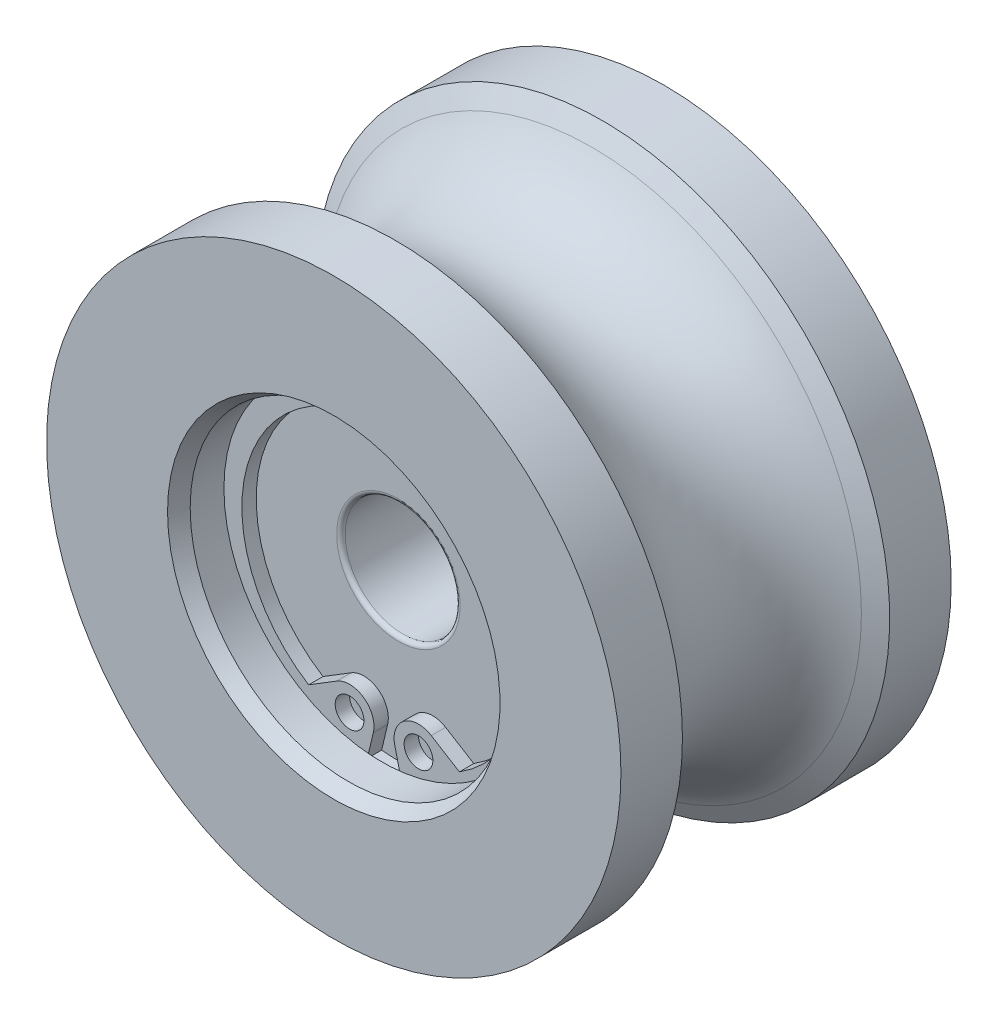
ISO-10303-21;
HEADER;
FILE_DESCRIPTION(('STEP AP214'),'2;1');
FILE_NAME('part.step','',(''),(''),'','','');
FILE_SCHEMA(('AUTOMOTIVE_DESIGN { 1 0 10303 214 1 1 1 1 }'));
ENDSEC;
DATA;
#1=APPLICATION_CONTEXT('core data for automotive mechanical design processes');
#2=APPLICATION_PROTOCOL_DEFINITION('international standard','automotive_design',2000,#1);
#3=PRODUCT_CONTEXT('',#1,'mechanical');
#4=PRODUCT('Part','Part','',(#3));
#5=PRODUCT_RELATED_PRODUCT_CATEGORY('part','',(#4));
#6=PRODUCT_DEFINITION_FORMATION('','',#4);
#7=PRODUCT_DEFINITION_CONTEXT('part definition',#1,'design');
#8=PRODUCT_DEFINITION('design','',#6,#7);
#9=PRODUCT_DEFINITION_SHAPE('','',#8);
#10=(LENGTH_UNIT() NAMED_UNIT(*) SI_UNIT(.MILLI.,.METRE.));
#11=(NAMED_UNIT(*) PLANE_ANGLE_UNIT() SI_UNIT($,.RADIAN.));
#12=(NAMED_UNIT(*) SI_UNIT($,.STERADIAN.) SOLID_ANGLE_UNIT());
#13=UNCERTAINTY_MEASURE_WITH_UNIT(LENGTH_MEASURE(1.E-05),#10,'distance_accuracy_value','');
#14=(GEOMETRIC_REPRESENTATION_CONTEXT(3) GLOBAL_UNCERTAINTY_ASSIGNED_CONTEXT((#13)) GLOBAL_UNIT_ASSIGNED_CONTEXT((#10,
#11,#12)) REPRESENTATION_CONTEXT('',''));
#15=CARTESIAN_POINT('',(0.,0.,0.));
#16=DIRECTION('',(0.,0.,1.));
#17=DIRECTION('',(1.,0.,0.));
#18=AXIS2_PLACEMENT_3D('',#15,#16,#17);
#19=CARTESIAN_POINT('',(0.,-0.65,8.));
#20=DIRECTION('',(0.,0.,1.));
#21=DIRECTION('',(-1.,0.,0.));
#22=AXIS2_PLACEMENT_3D('',#19,#20,#21);
#23=CYLINDRICAL_SURFACE('',#22,9.9);
#24=CARTESIAN_POINT('',(0.,-0.65,7.));
#25=DIRECTION('',(0.,0.,-1.));
#26=DIRECTION('',(0.,-1.,0.));
#27=AXIS2_PLACEMENT_3D('',#24,#25,#26);
#28=CIRCLE('',#27,9.9);
#29=CARTESIAN_POINT('',(-5.24892182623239,-9.04397520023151,7.));
#30=VERTEX_POINT('',#29);
#31=CARTESIAN_POINT('',(5.2489218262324,-9.04397520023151,7.));
#32=VERTEX_POINT('',#31);
#33=EDGE_CURVE('E605',#30,#32,#28,.T.);
#34=ORIENTED_EDGE('',*,*,#33,.T.);
#35=DIRECTION('',(0.,0.,-1.));
#36=VECTOR('',#35,1.);
#37=CARTESIAN_POINT('',(5.2489218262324,-9.04397520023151,8.));
#38=LINE('',#37,#36);
#39=CARTESIAN_POINT('',(5.2489218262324,-9.04397520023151,8.));
#40=VERTEX_POINT('',#39);
#41=EDGE_CURVE('E130',#40,#32,#38,.T.);
#42=ORIENTED_EDGE('',*,*,#41,.F.);
#43=CARTESIAN_POINT('',(0.,-0.65,8.));
#44=DIRECTION('',(0.,0.,-1.));
#45=DIRECTION('',(0.,-1.,0.));
#46=AXIS2_PLACEMENT_3D('',#43,#44,#45);
#47=CIRCLE('',#46,9.9);
#48=CARTESIAN_POINT('',(-5.24892182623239,-9.04397520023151,8.));
#49=VERTEX_POINT('',#48);
#50=EDGE_CURVE('E579',#49,#40,#47,.T.);
#51=ORIENTED_EDGE('',*,*,#50,.F.);
#52=DIRECTION('',(0.,0.,-1.));
#53=VECTOR('',#52,1.);
#54=CARTESIAN_POINT('',(-5.24892182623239,-9.04397520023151,8.));
#55=LINE('',#54,#53);
#56=EDGE_CURVE('E123',#49,#30,#55,.T.);
#57=ORIENTED_EDGE('',*,*,#56,.T.);
#58=EDGE_LOOP('',(#34,#42,#51,#57));
#59=FACE_BOUND('',#58,.T.);
#60=ADVANCED_FACE('F14',(#59),#23,.F.);
#61=CARTESIAN_POINT('',(3.29136923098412,-7.83857489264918,8.));
#62=DIRECTION('',(-0.524334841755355,-0.851512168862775,0.));
#63=DIRECTION('',(-0.851512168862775,0.524334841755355,0.));
#64=AXIS2_PLACEMENT_3D('',#61,#62,#63);
#65=PLANE('',#64);
#66=DIRECTION('',(-0.851512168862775,0.524334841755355,0.));
#67=VECTOR('',#66,1.);
#68=CARTESIAN_POINT('',(3.29136923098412,-7.83857489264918,7.));
#69=LINE('',#68,#67);
#70=CARTESIAN_POINT('',(3.29136923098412,-7.83857489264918,7.));
#71=VERTEX_POINT('',#70);
#72=EDGE_CURVE('E134',#32,#71,#69,.T.);
#73=ORIENTED_EDGE('',*,*,#72,.T.);
#74=DIRECTION('',(0.,0.,-1.));
#75=VECTOR('',#74,1.);
#76=CARTESIAN_POINT('',(3.29136923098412,-7.83857489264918,8.));
#77=LINE('',#76,#75);
#78=CARTESIAN_POINT('',(3.29136923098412,-7.83857489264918,8.));
#79=VERTEX_POINT('',#78);
#80=EDGE_CURVE('E96',#79,#71,#77,.T.);
#81=ORIENTED_EDGE('',*,*,#80,.F.);
#82=DIRECTION('',(-0.851512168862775,0.524334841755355,0.));
#83=VECTOR('',#82,1.);
#84=CARTESIAN_POINT('',(3.29136923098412,-7.83857489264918,8.));
#85=LINE('',#84,#83);
#86=EDGE_CURVE('E582',#40,#79,#85,.T.);
#87=ORIENTED_EDGE('',*,*,#86,.F.);
#88=ORIENTED_EDGE('',*,*,#41,.T.);
#89=EDGE_LOOP('',(#73,#81,#87,#88));
#90=FACE_BOUND('',#89,.T.);
#91=ADVANCED_FACE('F224',(#90),#65,.F.);
#92=CARTESIAN_POINT('',(2.4,-9.28614557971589,8.));
#93=DIRECTION('',(0.,0.,1.));
#94=DIRECTION('',(-1.,0.,0.));
#95=AXIS2_PLACEMENT_3D('',#92,#93,#94);
#96=CYLINDRICAL_SURFACE('',#95,1.7);
#97=CARTESIAN_POINT('',(2.4,-9.28614557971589,7.));
#98=DIRECTION('',(0.,0.,1.));
#99=DIRECTION('',(1.,0.,0.));
#100=AXIS2_PLACEMENT_3D('',#97,#98,#99);
#101=CIRCLE('',#100,1.7);
#102=CARTESIAN_POINT('',(0.746119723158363,-9.67943940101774,7.));
#103=VERTEX_POINT('',#102);
#104=EDGE_CURVE('E92',#71,#103,#101,.T.);
#105=ORIENTED_EDGE('',*,*,#104,.T.);
#106=DIRECTION('',(0.,0.,-1.));
#107=VECTOR('',#106,1.);
#108=CARTESIAN_POINT('',(0.746119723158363,-9.67943940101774,8.));
#109=LINE('',#108,#107);
#110=CARTESIAN_POINT('',(0.746119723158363,-9.67943940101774,8.));
#111=VERTEX_POINT('',#110);
#112=EDGE_CURVE('E95',#111,#103,#109,.T.);
#113=ORIENTED_EDGE('',*,*,#112,.F.);
#114=CARTESIAN_POINT('',(2.4,-9.28614557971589,8.));
#115=DIRECTION('',(0.,0.,1.));
#116=DIRECTION('',(1.,0.,0.));
#117=AXIS2_PLACEMENT_3D('',#114,#115,#116);
#118=CIRCLE('',#117,1.7);
#119=EDGE_CURVE('E567',#79,#111,#118,.T.);
#120=ORIENTED_EDGE('',*,*,#119,.F.);
#121=ORIENTED_EDGE('',*,*,#80,.T.);
#122=EDGE_LOOP('',(#105,#113,#120,#121));
#123=FACE_BOUND('',#122,.T.);
#124=ADVANCED_FACE('F93',(#123),#96,.T.);
#125=CARTESIAN_POINT('',(-0.746119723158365,-9.67943940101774,8.));
#126=DIRECTION('',(-0.97287075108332,0.231349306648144,0.));
#127=DIRECTION('',(0.,0.,1.));
#128=AXIS2_PLACEMENT_3D('',#125,#126,#127);
#129=PLANE('',#128);
#130=DIRECTION('',(0.,0.,-1.));
#131=VECTOR('',#130,1.);
#132=CARTESIAN_POINT('',(-1.16498191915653,-11.440839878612,-12.65));
#133=LINE('',#132,#131);
#134=CARTESIAN_POINT('',(-1.16498191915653,-11.440839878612,7.));
#135=VERTEX_POINT('',#134);
#136=CARTESIAN_POINT('',(-1.16498191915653,-11.440839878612,8.));
#137=VERTEX_POINT('',#136);
#138=EDGE_CURVE('E136',#135,#137,#133,.F.);
#139=ORIENTED_EDGE('',*,*,#138,.F.);
#140=DIRECTION('',(0.231349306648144,0.97287075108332,0.));
#141=VECTOR('',#140,1.);
#142=CARTESIAN_POINT('',(-0.746119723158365,-9.67943940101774,7.));
#143=LINE('',#142,#141);
#144=CARTESIAN_POINT('',(-0.746119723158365,-9.67943940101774,7.));
#145=VERTEX_POINT('',#144);
#146=EDGE_CURVE('E112',#135,#145,#143,.T.);
#147=ORIENTED_EDGE('',*,*,#146,.T.);
#148=DIRECTION('',(0.,0.,-1.));
#149=VECTOR('',#148,1.);
#150=CARTESIAN_POINT('',(-0.746119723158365,-9.67943940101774,8.));
#151=LINE('',#150,#149);
#152=CARTESIAN_POINT('',(-0.746119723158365,-9.67943940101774,8.));
#153=VERTEX_POINT('',#152);
#154=EDGE_CURVE('E586',#153,#145,#151,.T.);
#155=ORIENTED_EDGE('',*,*,#154,.F.);
#156=DIRECTION('',(0.231349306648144,0.97287075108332,0.));
#157=VECTOR('',#156,1.);
#158=CARTESIAN_POINT('',(-0.746119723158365,-9.67943940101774,8.));
#159=LINE('',#158,#157);
#160=EDGE_CURVE('E509',#137,#153,#159,.T.);
#161=ORIENTED_EDGE('',*,*,#160,.F.);
#162=EDGE_LOOP('',(#139,#147,#155,#161));
#163=FACE_BOUND('',#162,.T.);
#164=ADVANCED_FACE('F248',(#163),#129,.F.);
#165=CARTESIAN_POINT('',(0.,-0.65,8.));
#166=DIRECTION('',(0.,0.,-1.));
#167=DIRECTION('',(0.,-1.,0.));
#168=AXIS2_PLACEMENT_3D('',#165,#166,#167);
#169=PLANE('',#168);
#170=CARTESIAN_POINT('',(2.4,-9.28614557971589,8.));
#171=DIRECTION('',(0.,0.,1.));
#172=DIRECTION('',(1.,0.,0.));
#173=AXIS2_PLACEMENT_3D('',#170,#171,#172);
#174=CIRCLE('',#173,1.);
#175=CARTESIAN_POINT('',(3.4,-9.28614557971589,8.));
#176=VERTEX_POINT('',#175);
#177=EDGE_CURVE('E125',#176,#176,#174,.T.);
#178=ORIENTED_EDGE('',*,*,#177,.F.);
#179=EDGE_LOOP('',(#178));
#180=FACE_BOUND('',#179,.T.);
#181=CARTESIAN_POINT('',(-2.4,-9.28614557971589,8.));
#182=DIRECTION('',(0.,0.,-1.));
#183=DIRECTION('',(1.,0.,0.));
#184=AXIS2_PLACEMENT_3D('',#181,#182,#183);
#185=CIRCLE('',#184,1.);
#186=CARTESIAN_POINT('',(-1.4,-9.28614557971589,8.));
#187=VERTEX_POINT('',#186);
#188=EDGE_CURVE('E100',#187,#187,#185,.T.);
#189=ORIENTED_EDGE('',*,*,#188,.T.);
#190=EDGE_LOOP('',(#189));
#191=FACE_BOUND('',#190,.T.);
#192=CARTESIAN_POINT('',(0.,0.,8.));
#193=DIRECTION('',(0.,0.,-1.));
#194=DIRECTION('',(-1.,0.,0.));
#195=AXIS2_PLACEMENT_3D('',#192,#193,#194);
#196=CIRCLE('',#195,11.5);
#197=CARTESIAN_POINT('',(1.16498191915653,-11.440839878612,8.));
#198=VERTEX_POINT('',#197);
#199=EDGE_CURVE('E9',#137,#198,#196,.T.);
#200=ORIENTED_EDGE('',*,*,#199,.F.);
#201=ORIENTED_EDGE('',*,*,#160,.T.);
#202=CARTESIAN_POINT('',(-2.4,-9.28614557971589,8.));
#203=DIRECTION('',(0.,0.,1.));
#204=DIRECTION('',(-1.,0.,0.));
#205=AXIS2_PLACEMENT_3D('',#202,#203,#204);
#206=CIRCLE('',#205,1.7);
#207=CARTESIAN_POINT('',(-3.29136923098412,-7.83857489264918,8.));
#208=VERTEX_POINT('',#207);
#209=EDGE_CURVE('E511',#153,#208,#206,.T.);
#210=ORIENTED_EDGE('',*,*,#209,.T.);
#211=DIRECTION('',(-0.851512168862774,-0.524334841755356,0.));
#212=VECTOR('',#211,1.);
#213=CARTESIAN_POINT('',(-3.29136923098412,-7.83857489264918,8.));
#214=LINE('',#213,#212);
#215=EDGE_CURVE('E135',#208,#49,#214,.T.);
#216=ORIENTED_EDGE('',*,*,#215,.T.);
#217=ORIENTED_EDGE('',*,*,#50,.T.);
#218=ORIENTED_EDGE('',*,*,#86,.T.);
#219=ORIENTED_EDGE('',*,*,#119,.T.);
#220=DIRECTION('',(0.231349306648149,-0.972870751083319,0.));
#221=VECTOR('',#220,1.);
#222=CARTESIAN_POINT('',(0.746119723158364,-9.67943940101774,8.));
#223=LINE('',#222,#221);
#224=EDGE_CURVE('E109',#111,#198,#223,.T.);
#225=ORIENTED_EDGE('',*,*,#224,.T.);
#226=EDGE_LOOP('',(#200,#201,#210,#216,#217,#218,#219,#225));
#227=FACE_BOUND('',#226,.T.);
#228=ADVANCED_FACE('F241',(#180,#191,#227),#169,.F.);
#229=CARTESIAN_POINT('',(2.4,-9.28614557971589,8.));
#230=DIRECTION('',(0.,0.,1.));
#231=DIRECTION('',(-1.,0.,0.));
#232=AXIS2_PLACEMENT_3D('',#229,#230,#231);
#233=CYLINDRICAL_SURFACE('',#232,1.);
#234=CARTESIAN_POINT('',(2.4,-9.28614557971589,7.));
#235=DIRECTION('',(0.,0.,1.));
#236=DIRECTION('',(1.,0.,0.));
#237=AXIS2_PLACEMENT_3D('',#234,#235,#236);
#238=CIRCLE('',#237,1.);
#239=CARTESIAN_POINT('',(3.4,-9.28614557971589,7.));
#240=VERTEX_POINT('',#239);
#241=EDGE_CURVE('E601',#240,#240,#238,.T.);
#242=ORIENTED_EDGE('',*,*,#241,.F.);
#243=EDGE_LOOP('',(#242));
#244=FACE_BOUND('',#243,.T.);
#245=ORIENTED_EDGE('',*,*,#177,.T.);
#246=EDGE_LOOP('',(#245));
#247=FACE_BOUND('',#246,.T.);
#248=ADVANCED_FACE('F237',(#244,#247),#233,.F.);
#249=CARTESIAN_POINT('',(-2.4,-9.28614557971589,8.));
#250=DIRECTION('',(0.,0.,1.));
#251=DIRECTION('',(-1.,0.,0.));
#252=AXIS2_PLACEMENT_3D('',#249,#250,#251);
#253=CYLINDRICAL_SURFACE('',#252,1.);
#254=CARTESIAN_POINT('',(-2.4,-9.28614557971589,7.));
#255=DIRECTION('',(0.,0.,-1.));
#256=DIRECTION('',(1.,0.,0.));
#257=AXIS2_PLACEMENT_3D('',#254,#255,#256);
#258=CIRCLE('',#257,1.);
#259=CARTESIAN_POINT('',(-1.4,-9.28614557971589,7.));
#260=VERTEX_POINT('',#259);
#261=EDGE_CURVE('E128',#260,#260,#258,.T.);
#262=ORIENTED_EDGE('',*,*,#261,.T.);
#263=EDGE_LOOP('',(#262));
#264=FACE_BOUND('',#263,.T.);
#265=ORIENTED_EDGE('',*,*,#188,.F.);
#266=EDGE_LOOP('',(#265));
#267=FACE_BOUND('',#266,.T.);
#268=ADVANCED_FACE('F233',(#264,#267),#253,.F.);
#269=CARTESIAN_POINT('',(-3.29136923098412,-7.83857489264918,8.));
#270=DIRECTION('',(0.524334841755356,-0.851512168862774,0.));
#271=DIRECTION('',(0.,0.,-1.));
#272=AXIS2_PLACEMENT_3D('',#269,#270,#271);
#273=PLANE('',#272);
#274=DIRECTION('',(-0.851512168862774,-0.524334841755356,0.));
#275=VECTOR('',#274,1.);
#276=CARTESIAN_POINT('',(-3.29136923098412,-7.83857489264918,7.));
#277=LINE('',#276,#275);
#278=CARTESIAN_POINT('',(-3.29136923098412,-7.83857489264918,7.));
#279=VERTEX_POINT('',#278);
#280=EDGE_CURVE('E138',#279,#30,#277,.T.);
#281=ORIENTED_EDGE('',*,*,#280,.T.);
#282=ORIENTED_EDGE('',*,*,#56,.F.);
#283=ORIENTED_EDGE('',*,*,#215,.F.);
#284=DIRECTION('',(0.,0.,-1.));
#285=VECTOR('',#284,1.);
#286=CARTESIAN_POINT('',(-3.29136923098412,-7.83857489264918,8.));
#287=LINE('',#286,#285);
#288=EDGE_CURVE('E594',#208,#279,#287,.T.);
#289=ORIENTED_EDGE('',*,*,#288,.T.);
#290=EDGE_LOOP('',(#281,#282,#283,#289));
#291=FACE_BOUND('',#290,.T.);
#292=ADVANCED_FACE('F236',(#291),#273,.F.);
#293=CARTESIAN_POINT('',(-2.4,-9.28614557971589,8.));
#294=DIRECTION('',(0.,0.,1.));
#295=DIRECTION('',(-1.,0.,0.));
#296=AXIS2_PLACEMENT_3D('',#293,#294,#295);
#297=CYLINDRICAL_SURFACE('',#296,1.7);
#298=CARTESIAN_POINT('',(-2.4,-9.28614557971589,7.));
#299=DIRECTION('',(0.,0.,1.));
#300=DIRECTION('',(-1.,0.,0.));
#301=AXIS2_PLACEMENT_3D('',#298,#299,#300);
#302=CIRCLE('',#301,1.7);
#303=EDGE_CURVE('E119',#145,#279,#302,.T.);
#304=ORIENTED_EDGE('',*,*,#303,.T.);
#305=ORIENTED_EDGE('',*,*,#288,.F.);
#306=ORIENTED_EDGE('',*,*,#209,.F.);
#307=ORIENTED_EDGE('',*,*,#154,.T.);
#308=EDGE_LOOP('',(#304,#305,#306,#307));
#309=FACE_BOUND('',#308,.T.);
#310=ADVANCED_FACE('F217',(#309),#297,.T.);
#311=CARTESIAN_POINT('',(0.746119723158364,-9.67943940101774,8.));
#312=DIRECTION('',(0.972870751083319,0.231349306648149,0.));
#313=DIRECTION('',(0.,0.,-1.));
#314=AXIS2_PLACEMENT_3D('',#311,#312,#313);
#315=PLANE('',#314);
#316=DIRECTION('',(0.,0.,-1.));
#317=VECTOR('',#316,1.);
#318=CARTESIAN_POINT('',(1.16498191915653,-11.440839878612,-12.65));
#319=LINE('',#318,#317);
#320=CARTESIAN_POINT('',(1.16498191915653,-11.440839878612,7.));
#321=VERTEX_POINT('',#320);
#322=EDGE_CURVE('E18',#198,#321,#319,.T.);
#323=ORIENTED_EDGE('',*,*,#322,.F.);
#324=ORIENTED_EDGE('',*,*,#224,.F.);
#325=ORIENTED_EDGE('',*,*,#112,.T.);
#326=DIRECTION('',(0.231349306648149,-0.972870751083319,0.));
#327=VECTOR('',#326,1.);
#328=CARTESIAN_POINT('',(0.746119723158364,-9.67943940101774,7.));
#329=LINE('',#328,#327);
#330=EDGE_CURVE('E32',#103,#321,#329,.T.);
#331=ORIENTED_EDGE('',*,*,#330,.T.);
#332=EDGE_LOOP('',(#323,#324,#325,#331));
#333=FACE_BOUND('',#332,.T.);
#334=ADVANCED_FACE('F107',(#333),#315,.F.);
#335=CARTESIAN_POINT('',(0.,13.4426286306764,7.));
#336=DIRECTION('',(0.,0.,1.));
#337=DIRECTION('',(1.,0.,0.));
#338=AXIS2_PLACEMENT_3D('',#335,#336,#337);
#339=PLANE('',#338);
#340=ORIENTED_EDGE('',*,*,#241,.T.);
#341=EDGE_LOOP('',(#340));
#342=FACE_BOUND('',#341,.T.);
#343=ADVANCED_FACE('F207',(#342),#339,.T.);
#344=ORIENTED_EDGE('',*,*,#261,.F.);
#345=EDGE_LOOP('',(#344));
#346=FACE_BOUND('',#345,.T.);
#347=ADVANCED_FACE('F209',(#346),#339,.T.);
#348=CARTESIAN_POINT('',(0.,0.,-6.49519052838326));
#349=DIRECTION('',(0.,0.,-1.));
#350=DIRECTION('',(-1.,0.,0.));
#351=AXIS2_PLACEMENT_3D('',#348,#349,#350);
#352=CONICAL_SURFACE('',#351,18.75,1.04719755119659);
#353=CARTESIAN_POINT('',(0.,0.,-6.49519052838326));
#354=DIRECTION('',(0.,0.,-1.));
#355=DIRECTION('',(-1.,0.,0.));
#356=AXIS2_PLACEMENT_3D('',#353,#354,#355);
#357=CIRCLE('',#356,18.75);
#358=CARTESIAN_POINT('',(-18.75,0.,-6.49519052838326));
#359=VERTEX_POINT('',#358);
#360=EDGE_CURVE('E173',#359,#359,#357,.T.);
#361=ORIENTED_EDGE('',*,*,#360,.T.);
#362=EDGE_LOOP('',(#361));
#363=FACE_BOUND('',#362,.T.);
#364=CARTESIAN_POINT('',(0.,0.,-7.21687836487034));
#365=DIRECTION('',(0.,0.,-1.));
#366=DIRECTION('',(-1.,0.,0.));
#367=AXIS2_PLACEMENT_3D('',#364,#365,#366);
#368=CIRCLE('',#367,20.);
#369=CARTESIAN_POINT('',(-20.,0.,-7.21687836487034));
#370=VERTEX_POINT('',#369);
#371=EDGE_CURVE('E142',#370,#370,#368,.T.);
#372=ORIENTED_EDGE('',*,*,#371,.F.);
#373=EDGE_LOOP('',(#372));
#374=FACE_BOUND('',#373,.T.);
#375=ADVANCED_FACE('F215',(#363,#374),#352,.T.);
#376=CARTESIAN_POINT('',(0.,0.,0.));
#377=DIRECTION('',(0.,0.,-1.));
#378=DIRECTION('',(-1.,0.,0.));
#379=AXIS2_PLACEMENT_3D('',#376,#377,#378);
#380=TOROIDAL_SURFACE('',#379,22.5,7.5);
#381=ORIENTED_EDGE('',*,*,#360,.F.);
#382=EDGE_LOOP('',(#381));
#383=FACE_BOUND('',#382,.T.);
#384=CARTESIAN_POINT('',(0.,0.,6.4951905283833));
#385=DIRECTION('',(0.,0.,-1.));
#386=DIRECTION('',(-1.,0.,0.));
#387=AXIS2_PLACEMENT_3D('',#384,#385,#386);
#388=CIRCLE('',#387,18.75);
#389=CARTESIAN_POINT('',(-18.75,0.,6.4951905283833));
#390=VERTEX_POINT('',#389);
#391=EDGE_CURVE('E146',#390,#390,#388,.T.);
#392=ORIENTED_EDGE('',*,*,#391,.T.);
#393=EDGE_LOOP('',(#392));
#394=FACE_BOUND('',#393,.T.);
#395=ADVANCED_FACE('F262',(#383,#394),#380,.F.);
#396=CARTESIAN_POINT('',(0.,0.,11.5));
#397=DIRECTION('',(0.,0.,-1.));
#398=DIRECTION('',(-1.,0.,0.));
#399=AXIS2_PLACEMENT_3D('',#396,#397,#398);
#400=CYLINDRICAL_SURFACE('',#399,20.);
#401=ORIENTED_EDGE('',*,*,#371,.T.);
#402=EDGE_LOOP('',(#401));
#403=FACE_BOUND('',#402,.T.);
#404=CARTESIAN_POINT('',(0.,0.,-11.5));
#405=DIRECTION('',(0.,0.,1.));
#406=DIRECTION('',(1.,0.,0.));
#407=AXIS2_PLACEMENT_3D('',#404,#405,#406);
#408=CIRCLE('',#407,20.);
#409=CARTESIAN_POINT('',(20.,0.,-11.5));
#410=VERTEX_POINT('',#409);
#411=EDGE_CURVE('E147',#410,#410,#408,.T.);
#412=ORIENTED_EDGE('',*,*,#411,.T.);
#413=EDGE_LOOP('',(#412));
#414=FACE_BOUND('',#413,.T.);
#415=ADVANCED_FACE('F258',(#403,#414),#400,.T.);
#416=CARTESIAN_POINT('',(0.,0.,13.7277786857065));
#417=DIRECTION('',(0.,0.,1.));
#418=DIRECTION('',(1.,0.,0.));
#419=AXIS2_PLACEMENT_3D('',#416,#417,#418);
#420=CONICAL_SURFACE('',#419,31.277210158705,1.0471975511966);
#421=ORIENTED_EDGE('',*,*,#391,.F.);
#422=EDGE_LOOP('',(#421));
#423=FACE_BOUND('',#422,.T.);
#424=CARTESIAN_POINT('',(0.,0.,7.2168783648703));
#425=DIRECTION('',(0.,0.,1.));
#426=DIRECTION('',(1.,0.,0.));
#427=AXIS2_PLACEMENT_3D('',#424,#425,#426);
#428=CIRCLE('',#427,20.);
#429=CARTESIAN_POINT('',(20.,0.,7.2168783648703));
#430=VERTEX_POINT('',#429);
#431=EDGE_CURVE('E139',#430,#430,#428,.T.);
#432=ORIENTED_EDGE('',*,*,#431,.F.);
#433=EDGE_LOOP('',(#432));
#434=FACE_BOUND('',#433,.T.);
#435=ADVANCED_FACE('F261',(#423,#434),#420,.T.);
#436=CARTESIAN_POINT('',(0.,0.,-11.5));
#437=DIRECTION('',(0.,0.,1.));
#438=DIRECTION('',(1.,0.,0.));
#439=AXIS2_PLACEMENT_3D('',#436,#437,#438);
#440=PLANE('',#439);
#441=CARTESIAN_POINT('',(0.,0.,-11.5));
#442=DIRECTION('',(0.,0.,-1.));
#443=DIRECTION('',(-1.,0.,0.));
#444=AXIS2_PLACEMENT_3D('',#441,#442,#443);
#445=CIRCLE('',#444,9.);
#446=CARTESIAN_POINT('',(-9.,0.,-11.5));
#447=VERTEX_POINT('',#446);
#448=EDGE_CURVE('E150',#447,#447,#445,.T.);
#449=ORIENTED_EDGE('',*,*,#448,.F.);
#450=EDGE_LOOP('',(#449));
#451=FACE_BOUND('',#450,.T.);
#452=ORIENTED_EDGE('',*,*,#411,.F.);
#453=EDGE_LOOP('',(#452));
#454=FACE_BOUND('',#453,.T.);
#455=ADVANCED_FACE('F265',(#451,#454),#440,.F.);
#456=ORIENTED_EDGE('',*,*,#431,.T.);
#457=EDGE_LOOP('',(#456));
#458=FACE_BOUND('',#457,.T.);
#459=CARTESIAN_POINT('',(0.,0.,11.5));
#460=DIRECTION('',(0.,0.,1.));
#461=DIRECTION('',(1.,0.,0.));
#462=AXIS2_PLACEMENT_3D('',#459,#460,#461);
#463=CIRCLE('',#462,20.);
#464=CARTESIAN_POINT('',(20.,0.,11.5));
#465=VERTEX_POINT('',#464);
#466=EDGE_CURVE('E151',#465,#465,#463,.T.);
#467=ORIENTED_EDGE('',*,*,#466,.F.);
#468=EDGE_LOOP('',(#467));
#469=FACE_BOUND('',#468,.T.);
#470=ADVANCED_FACE('F264',(#458,#469),#400,.T.);
#471=CARTESIAN_POINT('',(0.,0.,-12.65));
#472=DIRECTION('',(0.,0.,-1.));
#473=DIRECTION('',(-1.,0.,0.));
#474=AXIS2_PLACEMENT_3D('',#471,#472,#473);
#475=CYLINDRICAL_SURFACE('',#474,9.);
#476=CARTESIAN_POINT('',(0.,0.,-7.));
#477=DIRECTION('',(0.,0.,-1.));
#478=DIRECTION('',(-1.,0.,0.));
#479=AXIS2_PLACEMENT_3D('',#476,#477,#478);
#480=CIRCLE('',#479,9.);
#481=CARTESIAN_POINT('',(-9.,0.,-7.));
#482=VERTEX_POINT('',#481);
#483=EDGE_CURVE('E156',#482,#482,#480,.T.);
#484=ORIENTED_EDGE('',*,*,#483,.F.);
#485=EDGE_LOOP('',(#484));
#486=FACE_BOUND('',#485,.T.);
#487=ORIENTED_EDGE('',*,*,#448,.T.);
#488=EDGE_LOOP('',(#487));
#489=FACE_BOUND('',#488,.T.);
#490=ADVANCED_FACE('F203',(#486,#489),#475,.F.);
#491=CARTESIAN_POINT('',(0.,0.,11.5));
#492=DIRECTION('',(0.,0.,1.));
#493=DIRECTION('',(1.,0.,0.));
#494=AXIS2_PLACEMENT_3D('',#491,#492,#493);
#495=PLANE('',#494);
#496=CARTESIAN_POINT('',(0.,0.,11.5));
#497=DIRECTION('',(0.,0.,-1.));
#498=DIRECTION('',(-1.,0.,0.));
#499=AXIS2_PLACEMENT_3D('',#496,#497,#498);
#500=CIRCLE('',#499,11.5773502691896);
#501=CARTESIAN_POINT('',(-11.5773502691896,0.,11.5));
#502=VERTEX_POINT('',#501);
#503=EDGE_CURVE('E143',#502,#502,#500,.T.);
#504=ORIENTED_EDGE('',*,*,#503,.T.);
#505=EDGE_LOOP('',(#504));
#506=FACE_BOUND('',#505,.T.);
#507=ORIENTED_EDGE('',*,*,#466,.T.);
#508=EDGE_LOOP('',(#507));
#509=FACE_BOUND('',#508,.T.);
#510=ADVANCED_FACE('F193',(#506,#509),#495,.T.);
#511=CARTESIAN_POINT('',(0.,5.14332652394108,-6.99999999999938));
#512=DIRECTION('',(0.,0.,-1.));
#513=DIRECTION('',(-1.,0.,0.));
#514=AXIS2_PLACEMENT_3D('',#511,#512,#513);
#515=PLANE('',#514);
#516=ORIENTED_EDGE('',*,*,#483,.T.);
#517=EDGE_LOOP('',(#516));
#518=FACE_BOUND('',#517,.T.);
#519=CARTESIAN_POINT('',(0.,0.,-6.99999999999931));
#520=DIRECTION('',(0.,0.,-1.));
#521=DIRECTION('',(-1.,0.,0.));
#522=AXIS2_PLACEMENT_3D('',#519,#520,#521);
#523=CIRCLE('',#522,4.30000000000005);
#524=CARTESIAN_POINT('',(-4.30000000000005,0.,-6.99999999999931));
#525=VERTEX_POINT('',#524);
#526=EDGE_CURVE('E180',#525,#525,#523,.T.);
#527=ORIENTED_EDGE('',*,*,#526,.F.);
#528=EDGE_LOOP('',(#527));
#529=FACE_BOUND('',#528,.T.);
#530=ADVANCED_FACE('F190',(#518,#529),#515,.T.);
#531=CARTESIAN_POINT('',(0.,0.,10.5));
#532=DIRECTION('',(0.,0.,1.));
#533=DIRECTION('',(1.,0.,0.));
#534=AXIS2_PLACEMENT_3D('',#531,#532,#533);
#535=CONICAL_SURFACE('',#534,11.,0.523598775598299);
#536=ORIENTED_EDGE('',*,*,#503,.F.);
#537=EDGE_LOOP('',(#536));
#538=FACE_BOUND('',#537,.T.);
#539=CARTESIAN_POINT('',(0.,0.,10.5));
#540=DIRECTION('',(0.,0.,-1.));
#541=DIRECTION('',(-1.,0.,0.));
#542=AXIS2_PLACEMENT_3D('',#539,#540,#541);
#543=CIRCLE('',#542,11.);
#544=CARTESIAN_POINT('',(-11.,0.,10.5));
#545=VERTEX_POINT('',#544);
#546=EDGE_CURVE('E166',#545,#545,#543,.T.);
#547=ORIENTED_EDGE('',*,*,#546,.T.);
#548=EDGE_LOOP('',(#547));
#549=FACE_BOUND('',#548,.T.);
#550=ADVANCED_FACE('F192',(#538,#549),#535,.F.);
#551=CARTESIAN_POINT('',(0.,0.,-6.69999999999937));
#552=DIRECTION('',(0.,0.,-1.));
#553=DIRECTION('',(-1.,0.,0.));
#554=AXIS2_PLACEMENT_3D('',#551,#552,#553);
#555=TOROIDAL_SURFACE('',#554,4.30000000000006,0.299999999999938);
#556=CARTESIAN_POINT('',(0.,0.,-6.69999999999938));
#557=DIRECTION('',(0.,0.,-1.));
#558=DIRECTION('',(-1.,0.,0.));
#559=AXIS2_PLACEMENT_3D('',#556,#557,#558);
#560=CIRCLE('',#559,4.00000000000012);
#561=CARTESIAN_POINT('',(-4.00000000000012,0.,-6.69999999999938));
#562=VERTEX_POINT('',#561);
#563=EDGE_CURVE('E176',#562,#562,#560,.T.);
#564=ORIENTED_EDGE('',*,*,#563,.F.);
#565=EDGE_LOOP('',(#564));
#566=FACE_BOUND('',#565,.T.);
#567=ORIENTED_EDGE('',*,*,#526,.T.);
#568=EDGE_LOOP('',(#567));
#569=FACE_BOUND('',#568,.T.);
#570=ADVANCED_FACE('F188',(#566,#569),#555,.T.);
#571=CARTESIAN_POINT('',(0.,0.,-12.65));
#572=DIRECTION('',(0.,0.,-1.));
#573=DIRECTION('',(-1.,0.,0.));
#574=AXIS2_PLACEMENT_3D('',#571,#572,#573);
#575=CYLINDRICAL_SURFACE('',#574,11.);
#576=ORIENTED_EDGE('',*,*,#546,.F.);
#577=EDGE_LOOP('',(#576));
#578=FACE_BOUND('',#577,.T.);
#579=CARTESIAN_POINT('',(0.,0.,8.15));
#580=DIRECTION('',(0.,0.,-1.));
#581=DIRECTION('',(-1.,0.,0.));
#582=AXIS2_PLACEMENT_3D('',#579,#580,#581);
#583=CIRCLE('',#582,11.);
#584=CARTESIAN_POINT('',(-11.,0.,8.15));
#585=VERTEX_POINT('',#584);
#586=EDGE_CURVE('E163',#585,#585,#583,.T.);
#587=ORIENTED_EDGE('',*,*,#586,.T.);
#588=EDGE_LOOP('',(#587));
#589=FACE_BOUND('',#588,.T.);
#590=ADVANCED_FACE('F281',(#578,#589),#575,.F.);
#591=CARTESIAN_POINT('',(0.,0.,-15.970716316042));
#592=DIRECTION('',(0.,0.,-1.));
#593=DIRECTION('',(-1.,0.,0.));
#594=AXIS2_PLACEMENT_3D('',#591,#592,#593);
#595=CYLINDRICAL_SURFACE('',#594,4.);
#596=ORIENTED_EDGE('',*,*,#563,.T.);
#597=EDGE_LOOP('',(#596));
#598=FACE_BOUND('',#597,.T.);
#599=CARTESIAN_POINT('',(0.,0.,6.6999999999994));
#600=DIRECTION('',(0.,0.,1.));
#601=DIRECTION('',(1.,0.,0.));
#602=AXIS2_PLACEMENT_3D('',#599,#600,#601);
#603=CIRCLE('',#602,4.00000000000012);
#604=CARTESIAN_POINT('',(4.00000000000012,0.,6.6999999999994));
#605=VERTEX_POINT('',#604);
#606=EDGE_CURVE('E177',#605,#605,#603,.T.);
#607=ORIENTED_EDGE('',*,*,#606,.T.);
#608=EDGE_LOOP('',(#607));
#609=FACE_BOUND('',#608,.T.);
#610=ADVANCED_FACE('F279',(#598,#609),#595,.F.);
#611=CARTESIAN_POINT('',(0.,11.,8.15));
#612=DIRECTION('',(0.,0.,1.));
#613=DIRECTION('',(1.,0.,0.));
#614=AXIS2_PLACEMENT_3D('',#611,#612,#613);
#615=PLANE('',#614);
#616=ORIENTED_EDGE('',*,*,#586,.F.);
#617=EDGE_LOOP('',(#616));
#618=FACE_BOUND('',#617,.T.);
#619=CARTESIAN_POINT('',(0.,0.,8.15));
#620=DIRECTION('',(0.,0.,-1.));
#621=DIRECTION('',(-1.,0.,0.));
#622=AXIS2_PLACEMENT_3D('',#619,#620,#621);
#623=CIRCLE('',#622,11.5);
#624=CARTESIAN_POINT('',(-11.5,0.,8.15));
#625=VERTEX_POINT('',#624);
#626=EDGE_CURVE('E160',#625,#625,#623,.T.);
#627=ORIENTED_EDGE('',*,*,#626,.T.);
#628=EDGE_LOOP('',(#627));
#629=FACE_BOUND('',#628,.T.);
#630=ADVANCED_FACE('F275',(#618,#629),#615,.F.);
#631=CARTESIAN_POINT('',(0.,0.,-12.65));
#632=DIRECTION('',(0.,0.,-1.));
#633=DIRECTION('',(-1.,0.,0.));
#634=AXIS2_PLACEMENT_3D('',#631,#632,#633);
#635=CYLINDRICAL_SURFACE('',#634,11.5);
#636=ORIENTED_EDGE('',*,*,#626,.F.);
#637=EDGE_LOOP('',(#636));
#638=FACE_BOUND('',#637,.T.);
#639=ORIENTED_EDGE('',*,*,#199,.T.);
#640=ORIENTED_EDGE('',*,*,#322,.T.);
#641=CARTESIAN_POINT('',(0.,0.,7.));
#642=DIRECTION('',(0.,0.,-1.));
#643=DIRECTION('',(-1.,0.,0.));
#644=AXIS2_PLACEMENT_3D('',#641,#642,#643);
#645=CIRCLE('',#644,11.5);
#646=EDGE_CURVE('E104',#321,#135,#645,.T.);
#647=ORIENTED_EDGE('',*,*,#646,.T.);
#648=ORIENTED_EDGE('',*,*,#138,.T.);
#649=EDGE_LOOP('',(#639,#640,#647,#648));
#650=FACE_BOUND('',#649,.T.);
#651=ADVANCED_FACE('F272',(#638,#650),#635,.F.);
#652=CARTESIAN_POINT('',(0.,0.,6.6999999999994));
#653=DIRECTION('',(0.,0.,1.));
#654=DIRECTION('',(1.,0.,0.));
#655=AXIS2_PLACEMENT_3D('',#652,#653,#654);
#656=TOROIDAL_SURFACE('',#655,4.30000000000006,0.299999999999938);
#657=ORIENTED_EDGE('',*,*,#606,.F.);
#658=EDGE_LOOP('',(#657));
#659=FACE_BOUND('',#658,.T.);
#660=CARTESIAN_POINT('',(0.,0.,6.9999999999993));
#661=DIRECTION('',(0.,0.,1.));
#662=DIRECTION('',(1.,0.,0.));
#663=AXIS2_PLACEMENT_3D('',#660,#661,#662);
#664=CIRCLE('',#663,4.30000000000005);
#665=CARTESIAN_POINT('',(4.30000000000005,0.,6.9999999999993));
#666=VERTEX_POINT('',#665);
#667=EDGE_CURVE('E129',#666,#666,#664,.T.);
#668=ORIENTED_EDGE('',*,*,#667,.T.);
#669=EDGE_LOOP('',(#668));
#670=FACE_BOUND('',#669,.T.);
#671=ADVANCED_FACE('F221',(#659,#670),#656,.T.);
#672=ORIENTED_EDGE('',*,*,#667,.F.);
#673=EDGE_LOOP('',(#672));
#674=FACE_BOUND('',#673,.T.);
#675=ORIENTED_EDGE('',*,*,#330,.F.);
#676=ORIENTED_EDGE('',*,*,#104,.F.);
#677=ORIENTED_EDGE('',*,*,#72,.F.);
#678=ORIENTED_EDGE('',*,*,#33,.F.);
#679=ORIENTED_EDGE('',*,*,#280,.F.);
#680=ORIENTED_EDGE('',*,*,#303,.F.);
#681=ORIENTED_EDGE('',*,*,#146,.F.);
#682=ORIENTED_EDGE('',*,*,#646,.F.);
#683=EDGE_LOOP('',(#675,#676,#677,#678,#679,#680,#681,#682));
#684=FACE_BOUND('',#683,.T.);
#685=ADVANCED_FACE('F16',(#674,#684),#339,.T.);
#686=CLOSED_SHELL('',(#60,#91,#124,#164,#228,#248,#268,#292,#310,#334,#343,#347,#375,#395,#415,
#435,#455,#470,#490,#510,#530,#550,#570,#590,#610,#630,#651,#671,#685));
#687=MANIFOLD_SOLID_BREP('B1',#686);
#688=ADVANCED_BREP_SHAPE_REPRESENTATION('',(#18,#687),#14);
#689=SHAPE_DEFINITION_REPRESENTATION(#9,#688);
ENDSEC;
END-ISO-10303-21;
